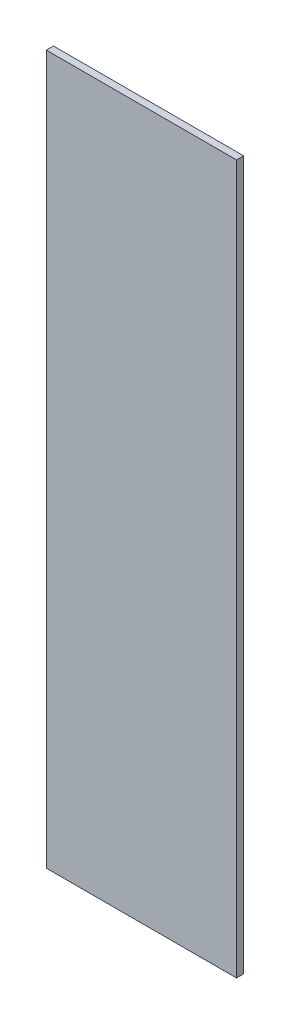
from build123d import *

# Parameters (mm, degrees)
CROQUIS2_W              = 400
CROQUIS2_H              = 1490
SALIENTE_EXTRUIR1_DEPTH = 15


with BuildPart() as part:
    # Croquis2 → Saliente-Extruir1 (new body)
    with BuildSketch(Plane.XY):
        Rectangle(CROQUIS2_W, CROQUIS2_H)
    extrude(amount=SALIENTE_EXTRUIR1_DEPTH)


solid = part.part
